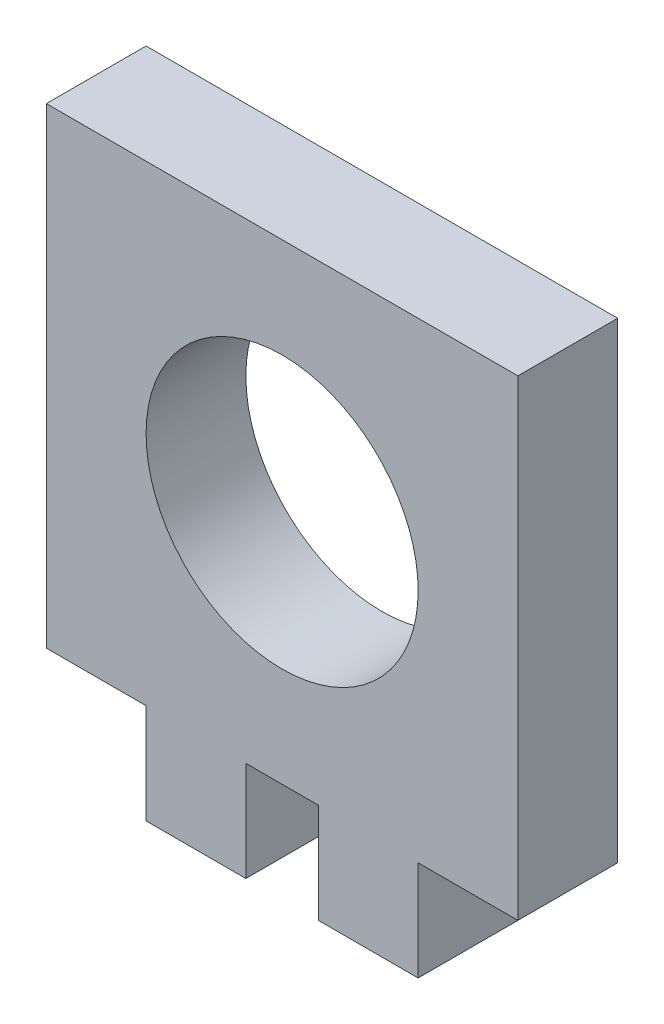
from build123d import *

# Parameters (mm, degrees)
SKETCH1_R           = 7.5
BOSS_EXTRUDE1_DEPTH = 5.5


with BuildPart() as part:
    # Sketch1 → Boss-Extrude1 (new body)
    with BuildSketch(Plane.XY):
        Polygon((-26, 31.5), (-26, 5.5), (-20.5, 5.5), (-20.5, 0), (-15, 0), (-15, 5.5), (-11, 5.5), (-11, 0), (-5.5, 0), (-5.5, 5.5), (0, 5.5), (0, 31.5), align=None)
        with Locations((-13, 18.5)):
            Circle(SKETCH1_R, mode=Mode.SUBTRACT)
    extrude(amount=BOSS_EXTRUDE1_DEPTH)


solid = part.part
